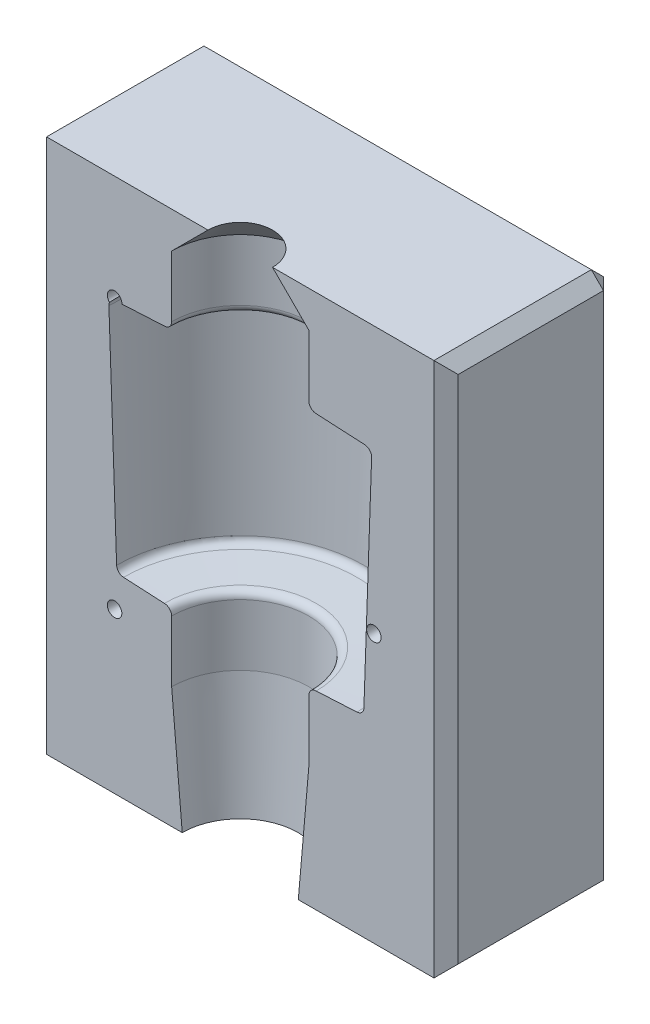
ISO-10303-21;
HEADER;
FILE_DESCRIPTION(('STEP AP214'),'2;1');
FILE_NAME('part.step','',(''),(''),'','','');
FILE_SCHEMA(('AUTOMOTIVE_DESIGN { 1 0 10303 214 1 1 1 1 }'));
ENDSEC;
DATA;
#1=APPLICATION_CONTEXT('core data for automotive mechanical design processes');
#2=APPLICATION_PROTOCOL_DEFINITION('international standard','automotive_design',2000,#1);
#3=PRODUCT_CONTEXT('',#1,'mechanical');
#4=PRODUCT('Part','Part','',(#3));
#5=PRODUCT_RELATED_PRODUCT_CATEGORY('part','',(#4));
#6=PRODUCT_DEFINITION_FORMATION('','',#4);
#7=PRODUCT_DEFINITION_CONTEXT('part definition',#1,'design');
#8=PRODUCT_DEFINITION('design','',#6,#7);
#9=PRODUCT_DEFINITION_SHAPE('','',#8);
#10=(LENGTH_UNIT() NAMED_UNIT(*) SI_UNIT(.MILLI.,.METRE.));
#11=(NAMED_UNIT(*) PLANE_ANGLE_UNIT() SI_UNIT($,.RADIAN.));
#12=(NAMED_UNIT(*) SI_UNIT($,.STERADIAN.) SOLID_ANGLE_UNIT());
#13=UNCERTAINTY_MEASURE_WITH_UNIT(LENGTH_MEASURE(1.E-05),#10,'distance_accuracy_value','');
#14=(GEOMETRIC_REPRESENTATION_CONTEXT(3) GLOBAL_UNCERTAINTY_ASSIGNED_CONTEXT((#13)) GLOBAL_UNIT_ASSIGNED_CONTEXT((#10,
#11,#12)) REPRESENTATION_CONTEXT('',''));
#15=CARTESIAN_POINT('',(0.,0.,0.));
#16=DIRECTION('',(0.,0.,1.));
#17=DIRECTION('',(1.,0.,0.));
#18=AXIS2_PLACEMENT_3D('',#15,#16,#17);
#19=CARTESIAN_POINT('',(-85.,92.9352226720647,-70.));
#20=DIRECTION('',(0.,1.,0.));
#21=DIRECTION('',(-1.,0.,0.));
#22=AXIS2_PLACEMENT_3D('',#19,#20,#21);
#23=PLANE('',#22);
#24=DIRECTION('',(-1.,0.,0.));
#25=VECTOR('',#24,1.);
#26=CARTESIAN_POINT('',(-85.,92.9352226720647,-65.));
#27=LINE('',#26,#25);
#28=CARTESIAN_POINT('',(80.,92.9352226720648,-65.));
#29=VERTEX_POINT('',#28);
#30=CARTESIAN_POINT('',(-80.,92.9352226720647,-65.));
#31=VERTEX_POINT('',#30);
#32=EDGE_CURVE('E50',#29,#31,#27,.T.);
#33=ORIENTED_EDGE('',*,*,#32,.T.);
#34=DIRECTION('',(0.,0.,1.));
#35=VECTOR('',#34,1.);
#36=CARTESIAN_POINT('',(-80.,92.9352226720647,-70.));
#37=LINE('',#36,#35);
#38=CARTESIAN_POINT('',(-80.,92.9352226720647,0.));
#39=VERTEX_POINT('',#38);
#40=EDGE_CURVE('E42',#31,#39,#37,.T.);
#41=ORIENTED_EDGE('',*,*,#40,.T.);
#42=DIRECTION('',(-1.,0.,0.));
#43=VECTOR('',#42,1.);
#44=CARTESIAN_POINT('',(-85.,92.9352226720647,0.));
#45=LINE('',#44,#43);
#46=CARTESIAN_POINT('',(-13.3400809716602,92.9352226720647,0.));
#47=VERTEX_POINT('',#46);
#48=EDGE_CURVE('E318',#47,#39,#45,.T.);
#49=ORIENTED_EDGE('',*,*,#48,.F.);
#50=CARTESIAN_POINT('',(-3.20923843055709E-13,92.9352226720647,0.));
#51=DIRECTION('',(0.,1.,0.));
#52=DIRECTION('',(-0.964273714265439,0.,0.264907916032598));
#53=AXIS2_PLACEMENT_3D('',#50,#51,#52);
#54=CIRCLE('',#53,13.3400809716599);
#55=CARTESIAN_POINT('',(13.3400809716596,92.9352226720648,0.));
#56=VERTEX_POINT('',#55);
#57=EDGE_CURVE('E446',#56,#47,#54,.T.);
#58=ORIENTED_EDGE('',*,*,#57,.F.);
#59=CARTESIAN_POINT('',(80.,92.9352226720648,0.));
#60=VERTEX_POINT('',#59);
#61=EDGE_CURVE('E319',#60,#56,#45,.T.);
#62=ORIENTED_EDGE('',*,*,#61,.F.);
#63=DIRECTION('',(0.,0.,-1.));
#64=VECTOR('',#63,1.);
#65=CARTESIAN_POINT('',(80.,92.9352226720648,-70.));
#66=LINE('',#65,#64);
#67=EDGE_CURVE('E55',#60,#29,#66,.T.);
#68=ORIENTED_EDGE('',*,*,#67,.T.);
#69=EDGE_LOOP('',(#33,#41,#49,#58,#62,#68));
#70=FACE_BOUND('',#69,.T.);
#71=ADVANCED_FACE('F33',(#70),#23,.T.);
#72=CARTESIAN_POINT('',(-85.,-127.935222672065,-70.));
#73=DIRECTION('',(0.,-1.,0.));
#74=DIRECTION('',(0.,0.,-1.));
#75=AXIS2_PLACEMENT_3D('',#72,#73,#74);
#76=PLANE('',#75);
#77=DIRECTION('',(1.,0.,0.));
#78=VECTOR('',#77,1.);
#79=CARTESIAN_POINT('',(-85.,-127.935222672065,0.));
#80=LINE('',#79,#78);
#81=CARTESIAN_POINT('',(-80.,-127.935222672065,0.));
#82=VERTEX_POINT('',#81);
#83=CARTESIAN_POINT('',(-23.9656477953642,-127.935222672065,0.));
#84=VERTEX_POINT('',#83);
#85=EDGE_CURVE('E316',#82,#84,#80,.T.);
#86=ORIENTED_EDGE('',*,*,#85,.F.);
#87=DIRECTION('',(0.,0.,-1.));
#88=VECTOR('',#87,1.);
#89=CARTESIAN_POINT('',(-80.,-127.935222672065,-70.));
#90=LINE('',#89,#88);
#91=CARTESIAN_POINT('',(-80.,-127.935222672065,-65.));
#92=VERTEX_POINT('',#91);
#93=EDGE_CURVE('E326',#82,#92,#90,.T.);
#94=ORIENTED_EDGE('',*,*,#93,.T.);
#95=DIRECTION('',(1.,0.,0.));
#96=VECTOR('',#95,1.);
#97=CARTESIAN_POINT('',(85.,-127.935222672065,-65.));
#98=LINE('',#97,#96);
#99=CARTESIAN_POINT('',(80.,-127.935222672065,-65.));
#100=VERTEX_POINT('',#99);
#101=EDGE_CURVE('E323',#92,#100,#98,.T.);
#102=ORIENTED_EDGE('',*,*,#101,.T.);
#103=DIRECTION('',(0.,0.,1.));
#104=VECTOR('',#103,1.);
#105=CARTESIAN_POINT('',(80.,-127.935222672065,-70.));
#106=LINE('',#105,#104);
#107=CARTESIAN_POINT('',(80.,-127.935222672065,0.));
#108=VERTEX_POINT('',#107);
#109=EDGE_CURVE('E321',#100,#108,#106,.T.);
#110=ORIENTED_EDGE('',*,*,#109,.T.);
#111=CARTESIAN_POINT('',(23.9656477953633,-127.935222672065,0.));
#112=VERTEX_POINT('',#111);
#113=EDGE_CURVE('E315',#112,#108,#80,.T.);
#114=ORIENTED_EDGE('',*,*,#113,.F.);
#115=CARTESIAN_POINT('',(-4.49293380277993E-13,-127.935222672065,0.));
#116=DIRECTION('',(0.,-1.,0.));
#117=DIRECTION('',(0.964273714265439,0.,-0.264907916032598));
#118=AXIS2_PLACEMENT_3D('',#115,#116,#117);
#119=CIRCLE('',#118,23.9656477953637);
#120=EDGE_CURVE('E444',#84,#112,#119,.T.);
#121=ORIENTED_EDGE('',*,*,#120,.F.);
#122=EDGE_LOOP('',(#86,#94,#102,#110,#114,#121));
#123=FACE_BOUND('',#122,.T.);
#124=ADVANCED_FACE('F545',(#123),#76,.T.);
#125=CARTESIAN_POINT('',(-85.,-127.935222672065,0.));
#126=DIRECTION('',(0.,0.,1.));
#127=DIRECTION('',(1.,0.,0.));
#128=AXIS2_PLACEMENT_3D('',#125,#126,#127);
#129=PLANE('',#128);
#130=ORIENTED_EDGE('',*,*,#113,.T.);
#131=DIRECTION('',(0.,1.,0.));
#132=VECTOR('',#131,1.);
#133=CARTESIAN_POINT('',(80.,-127.935222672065,0.));
#134=LINE('',#133,#132);
#135=EDGE_CURVE('E11',#108,#60,#134,.T.);
#136=ORIENTED_EDGE('',*,*,#135,.T.);
#137=ORIENTED_EDGE('',*,*,#61,.T.);
#138=DIRECTION('',(-0.707106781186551,0.707106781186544,0.));
#139=VECTOR('',#138,1.);
#140=CARTESIAN_POINT('',(-3.65965075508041E-13,106.275303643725,0.));
#141=LINE('',#140,#139);
#142=CARTESIAN_POINT('',(28.3400809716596,77.9352226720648,0.));
#143=VERTEX_POINT('',#142);
#144=EDGE_CURVE('E489',#56,#143,#141,.F.);
#145=ORIENTED_EDGE('',*,*,#144,.T.);
#146=DIRECTION('',(0.,1.,0.));
#147=VECTOR('',#146,1.);
#148=CARTESIAN_POINT('',(28.3400809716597,49.5951417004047,0.));
#149=LINE('',#148,#147);
#150=CARTESIAN_POINT('',(28.3400809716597,52.6315789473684,0.));
#151=VERTEX_POINT('',#150);
#152=EDGE_CURVE('E487',#151,#143,#149,.T.);
#153=ORIENTED_EDGE('',*,*,#152,.F.);
#154=CARTESIAN_POINT('',(31.3765182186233,52.6315789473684,0.));
#155=DIRECTION('',(0.,0.,1.));
#156=DIRECTION('',(1.,0.,0.));
#157=AXIS2_PLACEMENT_3D('',#154,#155,#156);
#158=CIRCLE('',#157,3.03643724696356);
#159=CARTESIAN_POINT('',(31.3765182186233,49.5951417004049,0.));
#160=VERTEX_POINT('',#159);
#161=EDGE_CURVE('E222',#151,#160,#158,.T.);
#162=ORIENTED_EDGE('',*,*,#161,.T.);
#163=DIRECTION('',(-0.998629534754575,0.0523359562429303,0.));
#164=VECTOR('',#163,1.);
#165=CARTESIAN_POINT('',(-1.86929983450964E-13,51.2395153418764,0.));
#166=LINE('',#165,#164);
#167=CARTESIAN_POINT('',(51.4134087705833,48.5450527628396,0.));
#168=VERTEX_POINT('',#167);
#169=EDGE_CURVE('E210',#168,#160,#166,.T.);
#170=ORIENTED_EDGE('',*,*,#169,.F.);
#171=CARTESIAN_POINT('',(51.2564009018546,45.5491641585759,0.));
#172=DIRECTION('',(0.,0.,1.));
#173=DIRECTION('',(1.,0.,0.));
#174=AXIS2_PLACEMENT_3D('',#171,#172,#173);
#175=CIRCLE('',#174,3.);
#176=CARTESIAN_POINT('',(54.2545733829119,45.4444656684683,0.));
#177=VERTEX_POINT('',#176);
#178=EDGE_CURVE('E195',#177,#168,#175,.T.);
#179=ORIENTED_EDGE('',*,*,#178,.F.);
#180=DIRECTION('',(0.0348994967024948,0.999390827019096,0.));
#181=VECTOR('',#180,1.);
#182=CARTESIAN_POINT('',(5.60880223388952E-12,-1508.20323948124,0.));
#183=LINE('',#182,#181);
#184=CARTESIAN_POINT('',(51.0675169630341,-45.8208891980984,0.));
#185=VERTEX_POINT('',#184);
#186=EDGE_CURVE('E301',#185,#177,#183,.T.);
#187=ORIENTED_EDGE('',*,*,#186,.F.);
#188=CARTESIAN_POINT('',(48.0693444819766,-45.7161907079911,0.));
#189=DIRECTION('',(0.,0.,1.));
#190=DIRECTION('',(1.,0.,0.));
#191=AXIS2_PLACEMENT_3D('',#188,#189,#190);
#192=CIRCLE('',#191,3.);
#193=CARTESIAN_POINT('',(48.2263523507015,-48.7120793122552,0.));
#194=VERTEX_POINT('',#193);
#195=EDGE_CURVE('E470',#194,#185,#192,.T.);
#196=ORIENTED_EDGE('',*,*,#195,.F.);
#197=DIRECTION('',(0.998629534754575,0.0523359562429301,0.));
#198=VECTOR('',#197,1.);
#199=CARTESIAN_POINT('',(-1.79221398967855E-13,-51.2395153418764,0.));
#200=LINE('',#199,#198);
#201=CARTESIAN_POINT('',(31.3765182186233,-49.5951417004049,0.));
#202=VERTEX_POINT('',#201);
#203=EDGE_CURVE('E476',#194,#202,#200,.F.);
#204=ORIENTED_EDGE('',*,*,#203,.T.);
#205=CARTESIAN_POINT('',(31.3765182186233,-52.6315789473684,0.));
#206=DIRECTION('',(0.,0.,1.));
#207=DIRECTION('',(1.,0.,0.));
#208=AXIS2_PLACEMENT_3D('',#205,#206,#207);
#209=CIRCLE('',#208,3.03643724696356);
#210=CARTESIAN_POINT('',(28.3400809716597,-52.6315789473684,0.));
#211=VERTEX_POINT('',#210);
#212=EDGE_CURVE('E480',#202,#211,#209,.T.);
#213=ORIENTED_EDGE('',*,*,#212,.T.);
#214=DIRECTION('',(0.,-1.,0.));
#215=VECTOR('',#214,1.);
#216=CARTESIAN_POINT('',(28.3400809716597,-49.5951417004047,0.));
#217=LINE('',#216,#215);
#218=CARTESIAN_POINT('',(28.3400809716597,-77.9352226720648,0.));
#219=VERTEX_POINT('',#218);
#220=EDGE_CURVE('E460',#219,#211,#217,.F.);
#221=ORIENTED_EDGE('',*,*,#220,.F.);
#222=DIRECTION('',(0.0871557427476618,0.996194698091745,0.));
#223=VECTOR('',#222,1.);
#224=CARTESIAN_POINT('',(-1.40334292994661E-12,-401.863830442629,0.));
#225=LINE('',#224,#223);
#226=EDGE_CURVE('E483',#219,#112,#225,.F.);
#227=ORIENTED_EDGE('',*,*,#226,.T.);
#228=EDGE_LOOP('',(#130,#136,#137,#145,#153,#162,#170,#179,#187,#196,#204,#213,#221,#227));
#229=FACE_BOUND('',#228,.T.);
#230=CARTESIAN_POINT('',(55.1779259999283,-17.1461572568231,0.));
#231=DIRECTION('',(0.,0.,1.));
#232=DIRECTION('',(1.,0.,0.));
#233=AXIS2_PLACEMENT_3D('',#230,#231,#232);
#234=CIRCLE('',#233,3.);
#235=CARTESIAN_POINT('',(58.1779259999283,-17.1461572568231,0.));
#236=VERTEX_POINT('',#235);
#237=EDGE_CURVE('E223',#236,#236,#234,.T.);
#238=ORIENTED_EDGE('',*,*,#237,.F.);
#239=EDGE_LOOP('',(#238));
#240=FACE_BOUND('',#239,.T.);
#241=ADVANCED_FACE('F219',(#229,#240),#129,.T.);
#242=ORIENTED_EDGE('',*,*,#48,.T.);
#243=DIRECTION('',(0.,-1.,0.));
#244=VECTOR('',#243,1.);
#245=CARTESIAN_POINT('',(-80.,-127.935222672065,0.));
#246=LINE('',#245,#244);
#247=EDGE_CURVE('E355',#39,#82,#246,.T.);
#248=ORIENTED_EDGE('',*,*,#247,.T.);
#249=ORIENTED_EDGE('',*,*,#85,.T.);
#250=DIRECTION('',(0.0871557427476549,-0.996194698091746,0.));
#251=VECTOR('',#250,1.);
#252=CARTESIAN_POINT('',(-1.40334292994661E-12,-401.863830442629,0.));
#253=LINE('',#252,#251);
#254=CARTESIAN_POINT('',(-28.3400809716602,-77.9352226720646,0.));
#255=VERTEX_POINT('',#254);
#256=EDGE_CURVE('E468',#84,#255,#253,.F.);
#257=ORIENTED_EDGE('',*,*,#256,.T.);
#258=DIRECTION('',(0.,-1.,0.));
#259=VECTOR('',#258,1.);
#260=CARTESIAN_POINT('',(-28.3400809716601,-49.5951417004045,0.));
#261=LINE('',#260,#259);
#262=CARTESIAN_POINT('',(-28.3400809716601,-52.6315789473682,0.));
#263=VERTEX_POINT('',#262);
#264=EDGE_CURVE('E457',#263,#255,#261,.T.);
#265=ORIENTED_EDGE('',*,*,#264,.F.);
#266=CARTESIAN_POINT('',(-31.3765182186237,-52.6315789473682,0.));
#267=DIRECTION('',(0.,0.,1.));
#268=DIRECTION('',(1.,0.,0.));
#269=AXIS2_PLACEMENT_3D('',#266,#267,#268);
#270=CIRCLE('',#269,3.03643724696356);
#271=CARTESIAN_POINT('',(-31.3765182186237,-49.5951417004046,0.));
#272=VERTEX_POINT('',#271);
#273=EDGE_CURVE('E466',#263,#272,#270,.T.);
#274=ORIENTED_EDGE('',*,*,#273,.T.);
#275=DIRECTION('',(0.998629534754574,-0.052335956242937,0.));
#276=VECTOR('',#275,1.);
#277=CARTESIAN_POINT('',(-1.79221398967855E-13,-51.2395153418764,0.));
#278=LINE('',#277,#276);
#279=CARTESIAN_POINT('',(-48.2263523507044,-48.7120793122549,0.));
#280=VERTEX_POINT('',#279);
#281=EDGE_CURVE('E857',#272,#280,#278,.F.);
#282=ORIENTED_EDGE('',*,*,#281,.T.);
#283=CARTESIAN_POINT('',(-48.0693444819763,-45.7161907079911,0.));
#284=DIRECTION('',(0.,0.,1.));
#285=DIRECTION('',(1.,0.,0.));
#286=AXIS2_PLACEMENT_3D('',#283,#284,#285);
#287=CIRCLE('',#286,3.);
#288=CARTESIAN_POINT('',(-51.0675169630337,-45.8208891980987,0.));
#289=VERTEX_POINT('',#288);
#290=EDGE_CURVE('E856',#289,#280,#287,.T.);
#291=ORIENTED_EDGE('',*,*,#290,.F.);
#292=DIRECTION('',(0.0348994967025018,-0.999390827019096,0.));
#293=VECTOR('',#292,1.);
#294=CARTESIAN_POINT('',(5.60880223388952E-12,-1508.20323948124,0.));
#295=LINE('',#294,#293);
#296=CARTESIAN_POINT('',(-54.2545733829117,45.4444656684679,0.));
#297=VERTEX_POINT('',#296);
#298=EDGE_CURVE('E298',#297,#289,#295,.T.);
#299=ORIENTED_EDGE('',*,*,#298,.F.);
#300=CARTESIAN_POINT('',(-51.2564009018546,45.5491641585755,0.));
#301=DIRECTION('',(0.,0.,1.));
#302=DIRECTION('',(1.,0.,0.));
#303=AXIS2_PLACEMENT_3D('',#300,#301,#302);
#304=CIRCLE('',#303,3.);
#305=CARTESIAN_POINT('',(-54.0021832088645,46.7577499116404,0.));
#306=VERTEX_POINT('',#305);
#307=EDGE_CURVE('E205',#306,#297,#304,.T.);
#308=ORIENTED_EDGE('',*,*,#307,.F.);
#309=CARTESIAN_POINT('',(-51.9184688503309,48.9160210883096,0.));
#310=DIRECTION('',(0.,0.,1.));
#311=DIRECTION('',(1.,0.,0.));
#312=AXIS2_PLACEMENT_3D('',#309,#310,#311);
#313=CIRCLE('',#312,3.);
#314=CARTESIAN_POINT('',(-48.9281422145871,48.6753000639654,0.));
#315=VERTEX_POINT('',#314);
#316=EDGE_CURVE('E234',#315,#306,#313,.T.);
#317=ORIENTED_EDGE('',*,*,#316,.F.);
#318=DIRECTION('',(-0.998629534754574,-0.0523359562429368,0.));
#319=VECTOR('',#318,1.);
#320=CARTESIAN_POINT('',(-1.86929983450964E-13,51.2395153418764,0.));
#321=LINE('',#320,#319);
#322=CARTESIAN_POINT('',(-31.3765182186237,49.5951417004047,0.));
#323=VERTEX_POINT('',#322);
#324=EDGE_CURVE('E224',#323,#315,#321,.T.);
#325=ORIENTED_EDGE('',*,*,#324,.F.);
#326=CARTESIAN_POINT('',(-31.3765182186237,52.6315789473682,0.));
#327=DIRECTION('',(0.,0.,1.));
#328=DIRECTION('',(1.,0.,0.));
#329=AXIS2_PLACEMENT_3D('',#326,#327,#328);
#330=CIRCLE('',#329,3.03643724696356);
#331=CARTESIAN_POINT('',(-28.3400809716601,52.6315789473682,0.));
#332=VERTEX_POINT('',#331);
#333=EDGE_CURVE('E435',#323,#332,#330,.T.);
#334=ORIENTED_EDGE('',*,*,#333,.T.);
#335=DIRECTION('',(0.,1.,0.));
#336=VECTOR('',#335,1.);
#337=CARTESIAN_POINT('',(-28.3400809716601,49.5951417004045,0.));
#338=LINE('',#337,#336);
#339=CARTESIAN_POINT('',(-28.3400809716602,77.9352226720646,0.));
#340=VERTEX_POINT('',#339);
#341=EDGE_CURVE('E426',#340,#332,#338,.F.);
#342=ORIENTED_EDGE('',*,*,#341,.F.);
#343=DIRECTION('',(-0.707106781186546,-0.707106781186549,0.));
#344=VECTOR('',#343,1.);
#345=CARTESIAN_POINT('',(-3.65965075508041E-13,106.275303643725,0.));
#346=LINE('',#345,#344);
#347=EDGE_CURVE('E425',#340,#47,#346,.F.);
#348=ORIENTED_EDGE('',*,*,#347,.T.);
#349=EDGE_LOOP('',(#242,#248,#249,#257,#265,#274,#282,#291,#299,#308,#317,#325,#334,#342,#348));
#350=FACE_BOUND('',#349,.T.);
#351=CARTESIAN_POINT('',(-51.9184688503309,-61.9636703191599,0.));
#352=DIRECTION('',(0.,0.,1.));
#353=DIRECTION('',(1.,0.,0.));
#354=AXIS2_PLACEMENT_3D('',#351,#352,#353);
#355=CIRCLE('',#354,3.);
#356=CARTESIAN_POINT('',(-48.9184688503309,-61.9636703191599,0.));
#357=VERTEX_POINT('',#356);
#358=EDGE_CURVE('E240',#357,#357,#355,.T.);
#359=ORIENTED_EDGE('',*,*,#358,.F.);
#360=EDGE_LOOP('',(#359));
#361=FACE_BOUND('',#360,.T.);
#362=ADVANCED_FACE('F292',(#350,#361),#129,.T.);
#363=CARTESIAN_POINT('',(-85.,92.9352226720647,-70.));
#364=DIRECTION('',(-1.,0.,0.));
#365=DIRECTION('',(0.,-1.,0.));
#366=AXIS2_PLACEMENT_3D('',#363,#364,#365);
#367=PLANE('',#366);
#368=DIRECTION('',(0.,0.,-1.));
#369=VECTOR('',#368,1.);
#370=CARTESIAN_POINT('',(-85.,87.9352226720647,-70.));
#371=LINE('',#370,#369);
#372=CARTESIAN_POINT('',(-85.,87.9352226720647,-5.00000000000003));
#373=VERTEX_POINT('',#372);
#374=CARTESIAN_POINT('',(-85.,87.9352226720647,-65.));
#375=VERTEX_POINT('',#374);
#376=EDGE_CURVE('E346',#373,#375,#371,.T.);
#377=ORIENTED_EDGE('',*,*,#376,.T.);
#378=DIRECTION('',(0.,-1.,0.));
#379=VECTOR('',#378,1.);
#380=CARTESIAN_POINT('',(-85.,-127.935222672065,-65.));
#381=LINE('',#380,#379);
#382=CARTESIAN_POINT('',(-85.,-122.935222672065,-65.));
#383=VERTEX_POINT('',#382);
#384=EDGE_CURVE('E352',#375,#383,#381,.T.);
#385=ORIENTED_EDGE('',*,*,#384,.T.);
#386=DIRECTION('',(0.,0.,1.));
#387=VECTOR('',#386,1.);
#388=CARTESIAN_POINT('',(-85.,-122.935222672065,-70.));
#389=LINE('',#388,#387);
#390=CARTESIAN_POINT('',(-85.,-122.935222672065,-5.00000000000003));
#391=VERTEX_POINT('',#390);
#392=EDGE_CURVE('E350',#383,#391,#389,.T.);
#393=ORIENTED_EDGE('',*,*,#392,.T.);
#394=DIRECTION('',(0.,1.,0.));
#395=VECTOR('',#394,1.);
#396=CARTESIAN_POINT('',(-85.,92.9352226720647,-5.00000000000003));
#397=LINE('',#396,#395);
#398=EDGE_CURVE('E348',#391,#373,#397,.T.);
#399=ORIENTED_EDGE('',*,*,#398,.T.);
#400=EDGE_LOOP('',(#377,#385,#393,#399));
#401=FACE_BOUND('',#400,.T.);
#402=ADVANCED_FACE('F414',(#401),#367,.T.);
#403=CARTESIAN_POINT('',(85.,92.9352226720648,-70.));
#404=DIRECTION('',(1.,0.,0.));
#405=DIRECTION('',(0.,1.,0.));
#406=AXIS2_PLACEMENT_3D('',#403,#404,#405);
#407=PLANE('',#406);
#408=DIRECTION('',(0.,0.,-1.));
#409=VECTOR('',#408,1.);
#410=CARTESIAN_POINT('',(85.,-122.935222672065,-70.));
#411=LINE('',#410,#409);
#412=CARTESIAN_POINT('',(85.,-122.935222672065,-5.));
#413=VERTEX_POINT('',#412);
#414=CARTESIAN_POINT('',(85.,-122.935222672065,-65.));
#415=VERTEX_POINT('',#414);
#416=EDGE_CURVE('E341',#413,#415,#411,.T.);
#417=ORIENTED_EDGE('',*,*,#416,.T.);
#418=DIRECTION('',(0.,1.,0.));
#419=VECTOR('',#418,1.);
#420=CARTESIAN_POINT('',(85.,92.9352226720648,-65.));
#421=LINE('',#420,#419);
#422=CARTESIAN_POINT('',(85.,87.9352226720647,-65.));
#423=VERTEX_POINT('',#422);
#424=EDGE_CURVE('E343',#415,#423,#421,.T.);
#425=ORIENTED_EDGE('',*,*,#424,.T.);
#426=DIRECTION('',(0.,0.,1.));
#427=VECTOR('',#426,1.);
#428=CARTESIAN_POINT('',(85.,87.9352226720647,-70.));
#429=LINE('',#428,#427);
#430=CARTESIAN_POINT('',(85.,87.9352226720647,-5.));
#431=VERTEX_POINT('',#430);
#432=EDGE_CURVE('E337',#423,#431,#429,.T.);
#433=ORIENTED_EDGE('',*,*,#432,.T.);
#434=DIRECTION('',(0.,-1.,0.));
#435=VECTOR('',#434,1.);
#436=CARTESIAN_POINT('',(85.,92.9352226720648,-5.));
#437=LINE('',#436,#435);
#438=EDGE_CURVE('E339',#431,#413,#437,.T.);
#439=ORIENTED_EDGE('',*,*,#438,.T.);
#440=EDGE_LOOP('',(#417,#425,#433,#439));
#441=FACE_BOUND('',#440,.T.);
#442=ADVANCED_FACE('F509',(#441),#407,.T.);
#443=CARTESIAN_POINT('',(-85.,-127.935222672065,-70.));
#444=DIRECTION('',(0.,0.,1.));
#445=DIRECTION('',(1.,0.,0.));
#446=AXIS2_PLACEMENT_3D('',#443,#444,#445);
#447=PLANE('',#446);
#448=DIRECTION('',(0.,-1.,0.));
#449=VECTOR('',#448,1.);
#450=CARTESIAN_POINT('',(80.,-127.935222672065,-70.));
#451=LINE('',#450,#449);
#452=CARTESIAN_POINT('',(80.,87.9352226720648,-70.));
#453=VERTEX_POINT('',#452);
#454=CARTESIAN_POINT('',(80.,-122.935222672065,-70.));
#455=VERTEX_POINT('',#454);
#456=EDGE_CURVE('E332',#453,#455,#451,.T.);
#457=ORIENTED_EDGE('',*,*,#456,.T.);
#458=DIRECTION('',(-1.,0.,0.));
#459=VECTOR('',#458,1.);
#460=CARTESIAN_POINT('',(-85.,-122.935222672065,-70.));
#461=LINE('',#460,#459);
#462=CARTESIAN_POINT('',(-80.,-122.935222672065,-70.));
#463=VERTEX_POINT('',#462);
#464=EDGE_CURVE('E334',#455,#463,#461,.T.);
#465=ORIENTED_EDGE('',*,*,#464,.T.);
#466=DIRECTION('',(0.,1.,0.));
#467=VECTOR('',#466,1.);
#468=CARTESIAN_POINT('',(-80.,92.9352226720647,-70.));
#469=LINE('',#468,#467);
#470=CARTESIAN_POINT('',(-80.,87.9352226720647,-70.));
#471=VERTEX_POINT('',#470);
#472=EDGE_CURVE('E330',#463,#471,#469,.T.);
#473=ORIENTED_EDGE('',*,*,#472,.T.);
#474=DIRECTION('',(1.,0.,0.));
#475=VECTOR('',#474,1.);
#476=CARTESIAN_POINT('',(85.,87.9352226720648,-70.));
#477=LINE('',#476,#475);
#478=EDGE_CURVE('E328',#471,#453,#477,.T.);
#479=ORIENTED_EDGE('',*,*,#478,.T.);
#480=EDGE_LOOP('',(#457,#465,#473,#479));
#481=FACE_BOUND('',#480,.T.);
#482=ADVANCED_FACE('F529',(#481),#447,.F.);
#483=CARTESIAN_POINT('',(-51.9184688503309,48.9160210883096,-5.));
#484=DIRECTION('',(0.,0.,1.));
#485=DIRECTION('',(1.,0.,0.));
#486=AXIS2_PLACEMENT_3D('',#483,#484,#485);
#487=PLANE('',#486);
#488=CARTESIAN_POINT('',(-51.9184688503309,48.9160210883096,-5.));
#489=DIRECTION('',(0.,0.,1.));
#490=DIRECTION('',(1.,0.,0.));
#491=AXIS2_PLACEMENT_3D('',#488,#489,#490);
#492=CIRCLE('',#491,2.11836509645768);
#493=CARTESIAN_POINT('',(-49.8215484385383,48.6153626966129,-5.));
#494=VERTEX_POINT('',#493);
#495=CARTESIAN_POINT('',(-53.3899467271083,47.3921367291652,-5.));
#496=VERTEX_POINT('',#495);
#497=EDGE_CURVE('E237',#494,#496,#492,.T.);
#498=ORIENTED_EDGE('',*,*,#497,.T.);
#499=CARTESIAN_POINT('',(-53.5058108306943,47.2335294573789,-5.));
#500=CARTESIAN_POINT('',(-53.6004437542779,47.0946455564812,-5.));
#501=CARTESIAN_POINT('',(-53.6834425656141,46.9476897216,-5.));
#502=CARTESIAN_POINT('',(-53.8236679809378,46.6418131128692,-5.));
#503=CARTESIAN_POINT('',(-53.8808646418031,46.482878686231,-5.));
#504=CARTESIAN_POINT('',(-53.9677179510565,46.1577011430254,-5.));
#505=CARTESIAN_POINT('',(-53.9973848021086,45.9914607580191,-5.));
#506=CARTESIAN_POINT('',(-54.0283329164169,45.6564022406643,-5.));
#507=CARTESIAN_POINT('',(-54.0296210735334,45.4875847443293,-5.));
#508=CARTESIAN_POINT('',(-54.0038128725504,45.1523590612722,-5.));
#509=CARTESIAN_POINT('',(-53.9767541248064,44.9859479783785,-5.));
#510=CARTESIAN_POINT('',(-53.8950943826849,44.6600219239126,-5.));
#511=CARTESIAN_POINT('',(-53.8404924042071,44.5005071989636,-5.));
#512=CARTESIAN_POINT('',(-53.705293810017,44.1928122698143,-5.));
#513=CARTESIAN_POINT('',(-53.6246845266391,44.0446376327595,-5.));
#514=CARTESIAN_POINT('',(-53.439802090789,43.7638733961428,-5.));
#515=CARTESIAN_POINT('',(-53.3355286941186,43.6312839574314,-5.));
#516=CARTESIAN_POINT('',(-53.1059673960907,43.3850302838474,-5.));
#517=CARTESIAN_POINT('',(-52.9806194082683,43.2714220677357,-5.));
#518=CARTESIAN_POINT('',(-52.7126989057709,43.066756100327,-5.));
#519=CARTESIAN_POINT('',(-52.5701260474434,42.9756987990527,-5.));
#520=CARTESIAN_POINT('',(-52.2711578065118,42.8183081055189,-5.));
#521=CARTESIAN_POINT('',(-52.114706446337,42.752081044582,-5.));
#522=CARTESIAN_POINT('',(-51.792933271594,42.6467161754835,-5.));
#523=CARTESIAN_POINT('',(-51.6276112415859,42.6075790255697,-5.));
#524=CARTESIAN_POINT('',(-51.2920936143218,42.5573615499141,-5.));
#525=CARTESIAN_POINT('',(-51.1218814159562,42.5463921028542,-5.));
#526=CARTESIAN_POINT('',(-50.7820238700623,42.5531246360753,-5.));
#527=CARTESIAN_POINT('',(-50.6123785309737,42.5708270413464,-5.));
#528=CARTESIAN_POINT('',(-50.2781290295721,42.6344715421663,-5.));
#529=CARTESIAN_POINT('',(-50.1135352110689,42.6804679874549,-5.));
#530=CARTESIAN_POINT('',(-49.7944177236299,42.7994709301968,-5.));
#531=CARTESIAN_POINT('',(-49.6398940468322,42.8724774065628,-5.));
#532=CARTESIAN_POINT('',(-49.3455103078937,43.0433692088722,-5.));
#533=CARTESIAN_POINT('',(-49.205633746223,43.1412261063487,-5.));
#534=CARTESIAN_POINT('',(-48.9443776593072,43.3591209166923,-5.));
#535=CARTESIAN_POINT('',(-48.8229977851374,43.4791584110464,-5.));
#536=CARTESIAN_POINT('',(-48.6027096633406,43.7375086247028,-5.));
#537=CARTESIAN_POINT('',(-48.5037141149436,43.8757468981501,-5.));
#538=CARTESIAN_POINT('',(-48.3304763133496,44.1669502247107,-5.));
#539=CARTESIAN_POINT('',(-48.2562333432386,44.3199148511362,-5.));
#540=CARTESIAN_POINT('',(-48.1350016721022,44.6353914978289,-5.));
#541=CARTESIAN_POINT('',(-48.0878759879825,44.7978508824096,-5.));
#542=CARTESIAN_POINT('',(-48.0216830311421,45.1283878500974,-5.));
#543=CARTESIAN_POINT('',(-48.0026150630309,45.2964652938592,-5.));
#544=CARTESIAN_POINT('',(-47.9931180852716,45.6327962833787,-5.));
#545=CARTESIAN_POINT('',(-48.00258234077,45.8010468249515,-5.));
#546=CARTESIAN_POINT('',(-48.0496390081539,46.1335655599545,-5.));
#547=CARTESIAN_POINT('',(-48.0872312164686,46.2978337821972,-5.));
#548=CARTESIAN_POINT('',(-48.1894184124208,46.6176598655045,-5.));
#549=CARTESIAN_POINT('',(-48.2540012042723,46.7732216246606,-5.));
#550=CARTESIAN_POINT('',(-48.4082897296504,47.0713405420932,-5.));
#551=CARTESIAN_POINT('',(-48.4979957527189,47.2138975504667,-5.));
#552=CARTESIAN_POINT('',(-48.7002564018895,47.4824416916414,-5.));
#553=CARTESIAN_POINT('',(-48.8128799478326,47.6083769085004,-5.));
#554=CARTESIAN_POINT('',(-49.0575774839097,47.8396680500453,-5.));
#555=CARTESIAN_POINT('',(-49.1896520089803,47.9450234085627,-5.));
#556=CARTESIAN_POINT('',(-49.4702044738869,48.132721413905,-5.));
#557=CARTESIAN_POINT('',(-49.6187607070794,48.2149470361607,-5.));
#558=CARTESIAN_POINT('',(-49.9275243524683,48.3534193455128,-5.));
#559=CARTESIAN_POINT('',(-50.087732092,48.4096653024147,-5.));
#560=CARTESIAN_POINT('',(-50.4160229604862,48.4948237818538,-5.));
#561=CARTESIAN_POINT('',(-50.5841381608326,48.523612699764,-5.));
#562=CARTESIAN_POINT('',(-50.9228103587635,48.5526186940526,-5.));
#563=CARTESIAN_POINT('',(-51.0933672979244,48.5528364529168,-5.));
#564=CARTESIAN_POINT('',(-51.432424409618,48.5246625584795,-5.));
#565=CARTESIAN_POINT('',(-51.6009201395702,48.4962174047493,-5.));
#566=CARTESIAN_POINT('',(-51.9307801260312,48.4113996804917,-5.));
#567=CARTESIAN_POINT('',(-52.092142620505,48.3550202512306,-5.));
#568=CARTESIAN_POINT('',(-52.4029547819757,48.2159576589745,-5.));
#569=CARTESIAN_POINT('',(-52.5524126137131,48.1332927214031,-5.));
#570=CARTESIAN_POINT('',(-52.8351220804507,47.9440079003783,-5.));
#571=CARTESIAN_POINT('',(-52.9683932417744,47.8374173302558,-5.));
#572=CARTESIAN_POINT('',(-53.1690811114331,47.6469357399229,-5.));
#573=CARTESIAN_POINT('',(-53.2425656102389,47.5693295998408,-5.));
#574=CARTESIAN_POINT('',(-53.3808690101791,47.4067448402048,-5.));
#575=CARTESIAN_POINT('',(-53.4456879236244,47.321766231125,-5.));
#576=CARTESIAN_POINT('',(-53.5058108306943,47.2335294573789,-5.));
#577=B_SPLINE_CURVE_WITH_KNOTS('',3,(#499,#500,#501,#502,#503,#504,#505,#506,#507,#508,#509,
#510,#511,#512,#513,#514,#515,#516,#517,#518,#519,#520,#521,#522,#523,#524,#525,#526,#527,#528,
#529,#530,#531,#532,#533,#534,#535,#536,#537,#538,#539,#540,#541,#542,#543,#544,#545,#546,#547,
#548,#549,#550,#551,#552,#553,#554,#555,#556,#557,#558,#559,#560,#561,#562,#563,#564,#565,#566,
#567,#568,#569,#570,#571,#572,#573,#574,#575,#576),.UNSPECIFIED.,.T.,.F.,(4,2,2,2,2,2,2,2,2,2,2,
2,2,2,2,2,2,2,2,2,2,2,2,2,2,2,2,2,2,2,2,2,2,2,2,2,2,2,4),(0.,0.503791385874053,1.00816592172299,
1.51235345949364,2.01641851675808,2.5198156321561,3.02323073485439,3.5268914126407,
4.03055728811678,4.53568432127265,5.04082143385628,5.54809765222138,6.05538619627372,
6.56466857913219,7.0739585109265,7.58422980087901,8.09450069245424,8.60419045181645,
9.11387059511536,9.62152727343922,10.1291692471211,10.634223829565,11.1392658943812,
11.6424210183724,12.1455725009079,12.64849687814,13.1514270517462,13.6558926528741,
14.1603721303,14.6673598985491,15.1743619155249,15.6836357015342,16.1928973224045,
16.7031112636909,17.2134505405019,17.7234367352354,18.2328014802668,18.5528745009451,
18.8729470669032),.UNSPECIFIED.);
#578=CARTESIAN_POINT('',(-51.169703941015,48.5450527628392,-5.));
#579=VERTEX_POINT('',#578);
#580=EDGE_CURVE('E246',#579,#496,#577,.T.);
#581=ORIENTED_EDGE('',*,*,#580,.F.);
#582=CARTESIAN_POINT('',(-47.4731345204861,48.7377925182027,-5.));
#583=CARTESIAN_POINT('',(-48.7147493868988,48.6730766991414,-5.));
#584=CARTESIAN_POINT('',(-49.9563630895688,48.6083385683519,-5.));
#585=CARTESIAN_POINT('',(-52.439588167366,48.4788176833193,-5.));
#586=CARTESIAN_POINT('',(-53.6811995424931,48.4140349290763,-5.));
#587=CARTESIAN_POINT('',(-54.9228097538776,48.3492298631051,-5.));
#588=B_SPLINE_CURVE_WITH_KNOTS('',3,(#582,#583,#584,#585,#586,#587),.UNSPECIFIED.,.F.,.F.,(4,2,
4),(0.,3.72990087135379,7.45980174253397),.UNSPECIFIED.);
#589=EDGE_CURVE('E213',#494,#579,#588,.T.);
#590=ORIENTED_EDGE('',*,*,#589,.F.);
#591=EDGE_LOOP('',(#498,#581,#590));
#592=FACE_BOUND('',#591,.T.);
#593=ADVANCED_FACE('F257',(#592),#487,.T.);
#594=CARTESIAN_POINT('',(1.83880688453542E-13,-45.7161907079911,0.));
#595=DIRECTION('',(0.,1.,0.));
#596=DIRECTION('',(0.264907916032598,0.,0.964273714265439));
#597=AXIS2_PLACEMENT_3D('',#594,#595,#596);
#598=TOROIDAL_SURFACE('',#597,48.0693444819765,3.);
#599=CARTESIAN_POINT('',(1.83880688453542E-13,-45.8208891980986,0.));
#600=DIRECTION('',(0.,1.,0.));
#601=DIRECTION('',(-0.964273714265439,0.,0.264907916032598));
#602=AXIS2_PLACEMENT_3D('',#599,#600,#601);
#603=CIRCLE('',#602,51.067516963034);
#604=EDGE_CURVE('E313',#185,#289,#603,.T.);
#605=ORIENTED_EDGE('',*,*,#604,.T.);
#606=ORIENTED_EDGE('',*,*,#290,.T.);
#607=CARTESIAN_POINT('',(1.85615411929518E-13,-48.712079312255,0.));
#608=DIRECTION('',(0.,1.,0.));
#609=DIRECTION('',(-0.964273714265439,0.,0.264907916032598));
#610=AXIS2_PLACEMENT_3D('',#607,#608,#609);
#611=CIRCLE('',#610,48.2263523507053);
#612=EDGE_CURVE('E215',#280,#194,#611,.F.);
#613=ORIENTED_EDGE('',*,*,#612,.T.);
#614=ORIENTED_EDGE('',*,*,#195,.T.);
#615=EDGE_LOOP('',(#605,#606,#613,#614));
#616=FACE_BOUND('',#615,.T.);
#617=ADVANCED_FACE('F738',(#616),#598,.F.);
#618=CARTESIAN_POINT('',(-1.83880688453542E-13,-52.6315789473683,0.));
#619=DIRECTION('',(0.,-1.,0.));
#620=DIRECTION('',(1.,0.,0.));
#621=AXIS2_PLACEMENT_3D('',#618,#619,#620);
#622=TOROIDAL_SURFACE('',#621,31.3765182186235,3.03643724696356);
#623=ORIENTED_EDGE('',*,*,#212,.F.);
#624=CARTESIAN_POINT('',(-1.73472347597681E-13,-49.5951417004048,0.));
#625=DIRECTION('',(0.,1.,0.));
#626=DIRECTION('',(-0.964273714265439,0.,0.264907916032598));
#627=AXIS2_PLACEMENT_3D('',#624,#625,#626);
#628=CIRCLE('',#627,31.3765182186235);
#629=EDGE_CURVE('E430',#202,#272,#628,.T.);
#630=ORIENTED_EDGE('',*,*,#629,.T.);
#631=ORIENTED_EDGE('',*,*,#273,.F.);
#632=CARTESIAN_POINT('',(-1.83880688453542E-13,-52.6315789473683,0.));
#633=DIRECTION('',(0.,-1.,0.));
#634=DIRECTION('',(1.,0.,0.));
#635=AXIS2_PLACEMENT_3D('',#632,#633,#634);
#636=CIRCLE('',#635,28.3400809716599);
#637=EDGE_CURVE('E308',#211,#263,#636,.F.);
#638=ORIENTED_EDGE('',*,*,#637,.F.);
#639=EDGE_LOOP('',(#623,#630,#631,#638));
#640=FACE_BOUND('',#639,.T.);
#641=ADVANCED_FACE('F729',(#640),#622,.T.);
#642=CARTESIAN_POINT('',(-1.73472347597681E-13,-49.5951417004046,0.));
#643=DIRECTION('',(0.,-1.,0.));
#644=DIRECTION('',(-1.,0.,0.));
#645=AXIS2_PLACEMENT_3D('',#642,#643,#644);
#646=CYLINDRICAL_SURFACE('',#645,28.3400809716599);
#647=ORIENTED_EDGE('',*,*,#637,.T.);
#648=ORIENTED_EDGE('',*,*,#264,.T.);
#649=CARTESIAN_POINT('',(-2.72351585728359E-13,-77.9352226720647,0.));
#650=DIRECTION('',(0.,-1.,0.));
#651=DIRECTION('',(0.964273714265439,0.,-0.264907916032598));
#652=AXIS2_PLACEMENT_3D('',#649,#650,#651);
#653=CIRCLE('',#652,28.3400809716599);
#654=EDGE_CURVE('E440',#255,#219,#653,.T.);
#655=ORIENTED_EDGE('',*,*,#654,.T.);
#656=ORIENTED_EDGE('',*,*,#220,.T.);
#657=EDGE_LOOP('',(#647,#648,#655,#656));
#658=FACE_BOUND('',#657,.T.);
#659=ADVANCED_FACE('F456',(#658),#646,.F.);
#660=CARTESIAN_POINT('',(-2.72351585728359E-13,-77.9352226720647,0.));
#661=DIRECTION('',(0.,1.,0.));
#662=DIRECTION('',(0.964273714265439,0.,-0.264907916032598));
#663=AXIS2_PLACEMENT_3D('',#660,#661,#662);
#664=CONICAL_SURFACE('',#663,28.3400809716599,0.0872664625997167);
#665=ORIENTED_EDGE('',*,*,#226,.F.);
#666=ORIENTED_EDGE('',*,*,#654,.F.);
#667=ORIENTED_EDGE('',*,*,#256,.F.);
#668=ORIENTED_EDGE('',*,*,#120,.T.);
#669=EDGE_LOOP('',(#665,#666,#667,#668));
#670=FACE_BOUND('',#669,.T.);
#671=ADVANCED_FACE('F710',(#670),#664,.F.);
#672=CARTESIAN_POINT('',(-1.73472347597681E-13,-49.5951417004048,0.));
#673=DIRECTION('',(0.,1.,0.));
#674=DIRECTION('',(-0.964273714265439,0.,0.264907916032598));
#675=AXIS2_PLACEMENT_3D('',#672,#673,#674);
#676=CONICAL_SURFACE('',#675,31.3765182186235,1.51843644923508);
#677=ORIENTED_EDGE('',*,*,#203,.F.);
#678=ORIENTED_EDGE('',*,*,#612,.F.);
#679=ORIENTED_EDGE('',*,*,#281,.F.);
#680=ORIENTED_EDGE('',*,*,#629,.F.);
#681=EDGE_LOOP('',(#677,#678,#679,#680));
#682=FACE_BOUND('',#681,.T.);
#683=ADVANCED_FACE('F701',(#682),#676,.F.);
#684=CARTESIAN_POINT('',(0.,45.5491641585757,0.));
#685=DIRECTION('',(0.,1.,0.));
#686=DIRECTION('',(-0.964273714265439,0.,0.264907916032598));
#687=AXIS2_PLACEMENT_3D('',#684,#685,#686);
#688=TOROIDAL_SURFACE('',#687,51.2564009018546,3.);
#689=CARTESIAN_POINT('',(-1.78676518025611E-13,48.5450527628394,0.));
#690=DIRECTION('',(0.,1.,0.));
#691=DIRECTION('',(-0.964273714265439,0.,0.264907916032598));
#692=AXIS2_PLACEMENT_3D('',#689,#690,#691);
#693=CIRCLE('',#692,51.4134087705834);
#694=EDGE_CURVE('E198',#168,#579,#693,.T.);
#695=ORIENTED_EDGE('',*,*,#694,.T.);
#696=ORIENTED_EDGE('',*,*,#580,.T.);
#697=CARTESIAN_POINT('',(-54.0021983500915,46.7577155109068,0.000200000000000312));
#698=CARTESIAN_POINT('',(-53.9864365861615,46.7935241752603,-0.207961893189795));
#699=CARTESIAN_POINT('',(-53.969202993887,46.8280501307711,-0.4162260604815));
#700=CARTESIAN_POINT('',(-53.9320099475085,46.8945982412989,-0.832902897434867));
#701=CARTESIAN_POINT('',(-53.91205060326,46.9266204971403,-1.04131556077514));
#702=CARTESIAN_POINT('',(-53.8484464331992,47.018973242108,-1.6663447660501));
#703=CARTESIAN_POINT('',(-53.8010465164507,47.0756534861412,-2.08312477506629));
#704=CARTESIAN_POINT('',(-53.6975897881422,47.1800739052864,-2.91665204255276));
#705=CARTESIAN_POINT('',(-53.6415341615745,47.2278153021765,-3.33339929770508));
#706=CARTESIAN_POINT('',(-53.5515571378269,47.2935763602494,-3.95846274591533));
#707=CARTESIAN_POINT('',(-53.5205671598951,47.3145297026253,-4.16690204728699));
#708=CARTESIAN_POINT('',(-53.4566692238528,47.3546439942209,-4.5836543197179));
#709=CARTESIAN_POINT('',(-53.4237613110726,47.3738049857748,-4.79196729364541));
#710=CARTESIAN_POINT('',(-53.3899142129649,47.3921543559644,-5.00019999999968));
#711=B_SPLINE_CURVE_WITH_KNOTS('',3,(#697,#698,#699,#700,#701,#702,#703,#704,#705,#706,#707,
#708,#709,#710),.UNSPECIFIED.,.F.,.F.,(4,2,2,2,2,2,4),(0.,0.635399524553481,1.27077344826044,
2.54038554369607,3.80982397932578,4.4451189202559,5.08039885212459),.UNSPECIFIED.);
#712=EDGE_CURVE('E267',#306,#496,#711,.T.);
#713=ORIENTED_EDGE('',*,*,#712,.F.);
#714=ORIENTED_EDGE('',*,*,#307,.T.);
#715=CARTESIAN_POINT('',(1.83880688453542E-13,45.4444656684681,0.));
#716=DIRECTION('',(0.,-1.,0.));
#717=DIRECTION('',(0.964273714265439,0.,-0.264907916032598));
#718=AXIS2_PLACEMENT_3D('',#715,#716,#717);
#719=CIRCLE('',#718,54.2545733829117);
#720=EDGE_CURVE('E200',#297,#177,#719,.T.);
#721=ORIENTED_EDGE('',*,*,#720,.T.);
#722=ORIENTED_EDGE('',*,*,#178,.T.);
#723=EDGE_LOOP('',(#695,#696,#713,#714,#721,#722));
#724=FACE_BOUND('',#723,.T.);
#725=ADVANCED_FACE('F197',(#724),#688,.F.);
#726=CARTESIAN_POINT('',(-1.83880688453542E-13,52.6315789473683,0.));
#727=DIRECTION('',(0.,1.,0.));
#728=DIRECTION('',(-1.,0.,0.));
#729=AXIS2_PLACEMENT_3D('',#726,#727,#728);
#730=TOROIDAL_SURFACE('',#729,31.3765182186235,3.03643724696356);
#731=ORIENTED_EDGE('',*,*,#161,.F.);
#732=CARTESIAN_POINT('',(-1.83880688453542E-13,52.6315789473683,0.));
#733=DIRECTION('',(0.,1.,0.));
#734=DIRECTION('',(-1.,0.,0.));
#735=AXIS2_PLACEMENT_3D('',#732,#733,#734);
#736=CIRCLE('',#735,28.3400809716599);
#737=EDGE_CURVE('E302',#332,#151,#736,.F.);
#738=ORIENTED_EDGE('',*,*,#737,.F.);
#739=ORIENTED_EDGE('',*,*,#333,.F.);
#740=CARTESIAN_POINT('',(-1.82145964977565E-13,49.5951417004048,0.));
#741=DIRECTION('',(0.,-1.,0.));
#742=DIRECTION('',(0.964273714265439,0.,-0.264907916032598));
#743=AXIS2_PLACEMENT_3D('',#740,#741,#742);
#744=CIRCLE('',#743,31.3765182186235);
#745=EDGE_CURVE('E433',#323,#160,#744,.T.);
#746=ORIENTED_EDGE('',*,*,#745,.T.);
#747=EDGE_LOOP('',(#731,#738,#739,#746));
#748=FACE_BOUND('',#747,.T.);
#749=ADVANCED_FACE('F493',(#748),#730,.T.);
#750=CARTESIAN_POINT('',(-1.73472347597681E-13,49.5951417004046,0.));
#751=DIRECTION('',(0.,1.,0.));
#752=DIRECTION('',(-1.,0.,0.));
#753=AXIS2_PLACEMENT_3D('',#750,#751,#752);
#754=CYLINDRICAL_SURFACE('',#753,28.3400809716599);
#755=CARTESIAN_POINT('',(-2.74086309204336E-13,77.9352226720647,0.));
#756=DIRECTION('',(0.,1.,0.));
#757=DIRECTION('',(-1.,0.,0.));
#758=AXIS2_PLACEMENT_3D('',#755,#756,#757);
#759=CIRCLE('',#758,28.3400809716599);
#760=EDGE_CURVE('E305',#143,#340,#759,.T.);
#761=ORIENTED_EDGE('',*,*,#760,.T.);
#762=ORIENTED_EDGE('',*,*,#341,.T.);
#763=ORIENTED_EDGE('',*,*,#737,.T.);
#764=ORIENTED_EDGE('',*,*,#152,.T.);
#765=EDGE_LOOP('',(#761,#762,#763,#764));
#766=FACE_BOUND('',#765,.T.);
#767=ADVANCED_FACE('F494',(#766),#754,.F.);
#768=CARTESIAN_POINT('',(-2.74086309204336E-13,77.9352226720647,0.));
#769=DIRECTION('',(0.,-1.,0.));
#770=DIRECTION('',(-0.964273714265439,0.,0.264907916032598));
#771=AXIS2_PLACEMENT_3D('',#768,#769,#770);
#772=CONICAL_SURFACE('',#771,28.3400809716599,0.785398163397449);
#773=ORIENTED_EDGE('',*,*,#144,.F.);
#774=ORIENTED_EDGE('',*,*,#57,.T.);
#775=ORIENTED_EDGE('',*,*,#347,.F.);
#776=ORIENTED_EDGE('',*,*,#760,.F.);
#777=EDGE_LOOP('',(#773,#774,#775,#776));
#778=FACE_BOUND('',#777,.T.);
#779=ADVANCED_FACE('F496',(#778),#772,.F.);
#780=CARTESIAN_POINT('',(-1.76941794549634E-13,48.1383240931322,0.));
#781=DIRECTION('',(0.,-1.,0.));
#782=DIRECTION('',(0.964273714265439,0.,-0.264907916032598));
#783=AXIS2_PLACEMENT_3D('',#780,#781,#782);
#784=CONICAL_SURFACE('',#783,59.1742541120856,1.51843644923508);
#785=ORIENTED_EDGE('',*,*,#745,.F.);
#786=ORIENTED_EDGE('',*,*,#324,.T.);
#787=CARTESIAN_POINT('',(-49.8215844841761,48.6153597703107,-5.0002));
#788=CARTESIAN_POINT('',(-49.7149084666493,48.6240215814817,-4.40815655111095));
#789=CARTESIAN_POINT('',(-49.6086420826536,48.6321358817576,-3.81603143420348));
#790=CARTESIAN_POINT('',(-49.3967024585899,48.6472530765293,-2.63166261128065));
#791=CARTESIAN_POINT('',(-49.291029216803,48.6542559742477,-2.03941890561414));
#792=CARTESIAN_POINT('',(-49.1425776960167,48.6633173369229,-1.20592585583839));
#793=CARTESIAN_POINT('',(-49.0996466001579,48.6658461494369,-0.964708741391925));
#794=CARTESIAN_POINT('',(-49.0138381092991,48.6707155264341,-0.482262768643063));
#795=CARTESIAN_POINT('',(-48.9709607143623,48.673056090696,-0.241033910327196));
#796=CARTESIAN_POINT('',(-48.9281066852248,48.675301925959,0.000200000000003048));
#797=B_SPLINE_CURVE_WITH_KNOTS('',3,(#787,#788,#789,#790,#791,#792,#793,#794,#795,#796),
.UNSPECIFIED.,.F.,.F.,(4,2,2,2,4),(0.,1.80491834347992,3.60983145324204,4.34489365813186,
5.07995672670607),.UNSPECIFIED.);
#798=EDGE_CURVE('E204',#494,#315,#797,.T.);
#799=ORIENTED_EDGE('',*,*,#798,.F.);
#800=ORIENTED_EDGE('',*,*,#589,.T.);
#801=ORIENTED_EDGE('',*,*,#694,.F.);
#802=ORIENTED_EDGE('',*,*,#169,.T.);
#803=EDGE_LOOP('',(#785,#786,#799,#800,#801,#802));
#804=FACE_BOUND('',#803,.T.);
#805=ADVANCED_FACE('F209',(#804),#784,.F.);
#806=CARTESIAN_POINT('',(5.41233724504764E-13,-56.7947734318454,0.));
#807=DIRECTION('',(0.,1.,0.));
#808=DIRECTION('',(-1.,0.,0.));
#809=AXIS2_PLACEMENT_3D('',#806,#807,#808);
#810=CONICAL_SURFACE('',#809,50.6843004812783,0.0349065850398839);
#811=ORIENTED_EDGE('',*,*,#720,.F.);
#812=ORIENTED_EDGE('',*,*,#298,.T.);
#813=ORIENTED_EDGE('',*,*,#604,.F.);
#814=ORIENTED_EDGE('',*,*,#186,.T.);
#815=EDGE_LOOP('',(#811,#812,#813,#814));
#816=FACE_BOUND('',#815,.T.);
#817=ADVANCED_FACE('F277',(#816),#810,.F.);
#818=CARTESIAN_POINT('',(-51.9184688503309,48.9160210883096,0.));
#819=DIRECTION('',(0.,0.,1.));
#820=DIRECTION('',(1.,0.,0.));
#821=AXIS2_PLACEMENT_3D('',#818,#819,#820);
#822=CONICAL_SURFACE('',#821,3.,0.174532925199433);
#823=ORIENTED_EDGE('',*,*,#798,.T.);
#824=ORIENTED_EDGE('',*,*,#316,.T.);
#825=ORIENTED_EDGE('',*,*,#712,.T.);
#826=ORIENTED_EDGE('',*,*,#497,.F.);
#827=EDGE_LOOP('',(#823,#824,#825,#826));
#828=FACE_BOUND('',#827,.T.);
#829=ADVANCED_FACE('F273',(#828),#822,.F.);
#830=CARTESIAN_POINT('',(55.1779259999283,-17.1461572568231,-5.));
#831=DIRECTION('',(0.,0.,1.));
#832=DIRECTION('',(1.,0.,0.));
#833=AXIS2_PLACEMENT_3D('',#830,#831,#832);
#834=PLANE('',#833);
#835=CARTESIAN_POINT('',(55.1779259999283,-17.1461572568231,-5.));
#836=DIRECTION('',(0.,0.,1.));
#837=DIRECTION('',(1.,0.,0.));
#838=AXIS2_PLACEMENT_3D('',#835,#836,#837);
#839=CIRCLE('',#838,2.11836509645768);
#840=CARTESIAN_POINT('',(57.2962910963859,-17.1461572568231,-5.));
#841=VERTEX_POINT('',#840);
#842=EDGE_CURVE('E227',#841,#841,#839,.T.);
#843=ORIENTED_EDGE('',*,*,#842,.T.);
#844=EDGE_LOOP('',(#843));
#845=FACE_BOUND('',#844,.T.);
#846=ADVANCED_FACE('F264',(#845),#834,.T.);
#847=CARTESIAN_POINT('',(55.1779259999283,-17.1461572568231,0.));
#848=DIRECTION('',(0.,0.,1.));
#849=DIRECTION('',(1.,0.,0.));
#850=AXIS2_PLACEMENT_3D('',#847,#848,#849);
#851=CONICAL_SURFACE('',#850,3.,0.174532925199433);
#852=ORIENTED_EDGE('',*,*,#842,.F.);
#853=EDGE_LOOP('',(#852));
#854=FACE_BOUND('',#853,.T.);
#855=ORIENTED_EDGE('',*,*,#237,.T.);
#856=EDGE_LOOP('',(#855));
#857=FACE_BOUND('',#856,.T.);
#858=ADVANCED_FACE('F599',(#854,#857),#851,.F.);
#859=CARTESIAN_POINT('',(-51.9184688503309,-61.9636703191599,0.));
#860=DIRECTION('',(0.,0.,1.));
#861=DIRECTION('',(1.,0.,0.));
#862=AXIS2_PLACEMENT_3D('',#859,#860,#861);
#863=CONICAL_SURFACE('',#862,3.,0.174532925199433);
#864=CARTESIAN_POINT('',(-51.9184688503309,-61.9636703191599,-5.));
#865=DIRECTION('',(0.,0.,1.));
#866=DIRECTION('',(1.,0.,0.));
#867=AXIS2_PLACEMENT_3D('',#864,#865,#866);
#868=CIRCLE('',#867,2.11836509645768);
#869=CARTESIAN_POINT('',(-49.8001037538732,-61.9636703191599,-5.));
#870=VERTEX_POINT('',#869);
#871=EDGE_CURVE('E243',#870,#870,#868,.T.);
#872=ORIENTED_EDGE('',*,*,#871,.F.);
#873=EDGE_LOOP('',(#872));
#874=FACE_BOUND('',#873,.T.);
#875=ORIENTED_EDGE('',*,*,#358,.T.);
#876=EDGE_LOOP('',(#875));
#877=FACE_BOUND('',#876,.T.);
#878=ADVANCED_FACE('F594',(#874,#877),#863,.F.);
#879=CARTESIAN_POINT('',(-51.9184688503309,-61.9636703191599,-5.));
#880=DIRECTION('',(0.,0.,1.));
#881=DIRECTION('',(1.,0.,0.));
#882=AXIS2_PLACEMENT_3D('',#879,#880,#881);
#883=PLANE('',#882);
#884=ORIENTED_EDGE('',*,*,#871,.T.);
#885=EDGE_LOOP('',(#884));
#886=FACE_BOUND('',#885,.T.);
#887=ADVANCED_FACE('F279',(#886),#883,.T.);
#888=CARTESIAN_POINT('',(-80.,92.9352226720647,-70.));
#889=DIRECTION('',(0.707106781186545,-0.707106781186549,0.));
#890=DIRECTION('',(0.707106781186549,0.707106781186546,0.));
#891=AXIS2_PLACEMENT_3D('',#888,#889,#890);
#892=PLANE('',#891);
#893=DIRECTION('',(0.577350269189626,0.577350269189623,0.577350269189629));
#894=VECTOR('',#893,1.);
#895=CARTESIAN_POINT('',(-103.333333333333,69.6018893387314,-23.3333333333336));
#896=LINE('',#895,#894);
#897=EDGE_CURVE('E395',#39,#373,#896,.F.);
#898=ORIENTED_EDGE('',*,*,#897,.F.);
#899=ORIENTED_EDGE('',*,*,#40,.F.);
#900=DIRECTION('',(-0.707106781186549,-0.707106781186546,0.));
#901=VECTOR('',#900,1.);
#902=CARTESIAN_POINT('',(-82.5,90.4352226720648,-65.));
#903=LINE('',#902,#901);
#904=EDGE_CURVE('E397',#375,#31,#903,.F.);
#905=ORIENTED_EDGE('',*,*,#904,.F.);
#906=ORIENTED_EDGE('',*,*,#376,.F.);
#907=EDGE_LOOP('',(#898,#899,#905,#906));
#908=FACE_BOUND('',#907,.T.);
#909=ADVANCED_FACE('F35',(#908),#892,.F.);
#910=CARTESIAN_POINT('',(85.,87.9352226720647,-70.));
#911=DIRECTION('',(-0.707106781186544,-0.70710678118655,0.));
#912=DIRECTION('',(0.70710678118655,-0.707106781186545,0.));
#913=AXIS2_PLACEMENT_3D('',#910,#911,#912);
#914=PLANE('',#913);
#915=DIRECTION('',(-0.70710678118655,0.707106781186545,0.));
#916=VECTOR('',#915,1.);
#917=CARTESIAN_POINT('',(85.,87.9352226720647,-65.));
#918=LINE('',#917,#916);
#919=EDGE_CURVE('E389',#29,#423,#918,.F.);
#920=ORIENTED_EDGE('',*,*,#919,.F.);
#921=ORIENTED_EDGE('',*,*,#67,.F.);
#922=DIRECTION('',(0.577350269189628,-0.577350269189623,-0.577350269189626));
#923=VECTOR('',#922,1.);
#924=CARTESIAN_POINT('',(106.666666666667,66.2685560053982,-26.6666666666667));
#925=LINE('',#924,#923);
#926=EDGE_CURVE('E392',#431,#60,#925,.F.);
#927=ORIENTED_EDGE('',*,*,#926,.F.);
#928=ORIENTED_EDGE('',*,*,#432,.F.);
#929=EDGE_LOOP('',(#920,#921,#927,#928));
#930=FACE_BOUND('',#929,.T.);
#931=ADVANCED_FACE('F500',(#930),#914,.F.);
#932=CARTESIAN_POINT('',(-85.,92.9352226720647,-65.));
#933=DIRECTION('',(0.,0.707106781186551,-0.707106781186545));
#934=DIRECTION('',(0.,0.707106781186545,0.70710678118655));
#935=AXIS2_PLACEMENT_3D('',#932,#933,#934);
#936=PLANE('',#935);
#937=DIRECTION('',(0.,-0.707106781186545,-0.70710678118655));
#938=VECTOR('',#937,1.);
#939=CARTESIAN_POINT('',(-80.,87.9352226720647,-70.));
#940=LINE('',#939,#938);
#941=EDGE_CURVE('E37',#31,#471,#940,.T.);
#942=ORIENTED_EDGE('',*,*,#941,.F.);
#943=ORIENTED_EDGE('',*,*,#32,.F.);
#944=DIRECTION('',(0.,0.707106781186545,0.70710678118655));
#945=VECTOR('',#944,1.);
#946=CARTESIAN_POINT('',(80.,90.4352226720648,-67.5));
#947=LINE('',#946,#945);
#948=EDGE_CURVE('E386',#453,#29,#947,.T.);
#949=ORIENTED_EDGE('',*,*,#948,.F.);
#950=ORIENTED_EDGE('',*,*,#478,.F.);
#951=EDGE_LOOP('',(#942,#943,#949,#950));
#952=FACE_BOUND('',#951,.T.);
#953=ADVANCED_FACE('F531',(#952),#936,.T.);
#954=CARTESIAN_POINT('',(-80.,87.9352226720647,-70.));
#955=DIRECTION('',(-0.577350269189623,0.57735026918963,-0.577350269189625));
#956=DIRECTION('',(0.,0.707106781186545,0.70710678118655));
#957=AXIS2_PLACEMENT_3D('',#954,#955,#956);
#958=PLANE('',#957);
#959=ORIENTED_EDGE('',*,*,#904,.T.);
#960=ORIENTED_EDGE('',*,*,#941,.T.);
#961=DIRECTION('',(-0.70710678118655,0.,0.707106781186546));
#962=VECTOR('',#961,1.);
#963=CARTESIAN_POINT('',(-80.,87.9352226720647,-70.));
#964=LINE('',#963,#962);
#965=EDGE_CURVE('E383',#375,#471,#964,.F.);
#966=ORIENTED_EDGE('',*,*,#965,.F.);
#967=EDGE_LOOP('',(#959,#960,#966));
#968=FACE_BOUND('',#967,.T.);
#969=ADVANCED_FACE('F404',(#968),#958,.T.);
#970=CARTESIAN_POINT('',(-80.,-127.935222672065,0.));
#971=DIRECTION('',(0.707106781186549,0.,-0.707106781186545));
#972=DIRECTION('',(-0.707106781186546,0.,-0.707106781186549));
#973=AXIS2_PLACEMENT_3D('',#970,#971,#972);
#974=PLANE('',#973);
#975=ORIENTED_EDGE('',*,*,#897,.T.);
#976=ORIENTED_EDGE('',*,*,#398,.F.);
#977=DIRECTION('',(0.577350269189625,-0.577350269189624,0.577350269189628));
#978=VECTOR('',#977,1.);
#979=CARTESIAN_POINT('',(-80.,-127.935222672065,0.));
#980=LINE('',#979,#978);
#981=EDGE_CURVE('E380',#82,#391,#980,.F.);
#982=ORIENTED_EDGE('',*,*,#981,.F.);
#983=ORIENTED_EDGE('',*,*,#247,.F.);
#984=EDGE_LOOP('',(#975,#976,#982,#983));
#985=FACE_BOUND('',#984,.T.);
#986=ADVANCED_FACE('F542',(#985),#974,.F.);
#987=CARTESIAN_POINT('',(80.,-127.935222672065,0.));
#988=DIRECTION('',(-0.707106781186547,0.,-0.707106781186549));
#989=DIRECTION('',(-0.707106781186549,0.,0.707106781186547));
#990=AXIS2_PLACEMENT_3D('',#987,#988,#989);
#991=PLANE('',#990);
#992=ORIENTED_EDGE('',*,*,#926,.T.);
#993=ORIENTED_EDGE('',*,*,#135,.F.);
#994=DIRECTION('',(0.577350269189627,0.577350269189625,-0.577350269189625));
#995=VECTOR('',#994,1.);
#996=CARTESIAN_POINT('',(80.,-127.935222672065,0.));
#997=LINE('',#996,#995);
#998=EDGE_CURVE('E377',#413,#108,#997,.F.);
#999=ORIENTED_EDGE('',*,*,#998,.F.);
#1000=ORIENTED_EDGE('',*,*,#438,.F.);
#1001=EDGE_LOOP('',(#992,#993,#999,#1000));
#1002=FACE_BOUND('',#1001,.T.);
#1003=ADVANCED_FACE('F505',(#1002),#991,.F.);
#1004=CARTESIAN_POINT('',(85.,87.9352226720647,-65.));
#1005=DIRECTION('',(0.577350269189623,0.577350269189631,-0.577350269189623));
#1006=DIRECTION('',(0.,0.707106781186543,0.707106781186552));
#1007=AXIS2_PLACEMENT_3D('',#1004,#1005,#1006);
#1008=PLANE('',#1007);
#1009=ORIENTED_EDGE('',*,*,#948,.T.);
#1010=ORIENTED_EDGE('',*,*,#919,.T.);
#1011=DIRECTION('',(-0.707106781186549,0.,-0.707106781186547));
#1012=VECTOR('',#1011,1.);
#1013=CARTESIAN_POINT('',(85.,87.9352226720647,-65.));
#1014=LINE('',#1013,#1012);
#1015=EDGE_CURVE('E375',#453,#423,#1014,.F.);
#1016=ORIENTED_EDGE('',*,*,#1015,.F.);
#1017=EDGE_LOOP('',(#1009,#1010,#1016));
#1018=FACE_BOUND('',#1017,.T.);
#1019=ADVANCED_FACE('F533',(#1018),#1008,.T.);
#1020=CARTESIAN_POINT('',(-85.,92.9352226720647,-65.));
#1021=DIRECTION('',(-0.707106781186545,0.,-0.707106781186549));
#1022=DIRECTION('',(-0.707106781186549,0.,0.707106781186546));
#1023=AXIS2_PLACEMENT_3D('',#1020,#1021,#1022);
#1024=PLANE('',#1023);
#1025=ORIENTED_EDGE('',*,*,#965,.T.);
#1026=ORIENTED_EDGE('',*,*,#472,.F.);
#1027=DIRECTION('',(0.707106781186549,0.,-0.707106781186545));
#1028=VECTOR('',#1027,1.);
#1029=CARTESIAN_POINT('',(-80.,-122.935222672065,-70.));
#1030=LINE('',#1029,#1028);
#1031=EDGE_CURVE('E372',#383,#463,#1030,.T.);
#1032=ORIENTED_EDGE('',*,*,#1031,.F.);
#1033=ORIENTED_EDGE('',*,*,#384,.F.);
#1034=EDGE_LOOP('',(#1025,#1026,#1032,#1033));
#1035=FACE_BOUND('',#1034,.T.);
#1036=ADVANCED_FACE('F410',(#1035),#1024,.T.);
#1037=CARTESIAN_POINT('',(-85.,-122.935222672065,-70.));
#1038=DIRECTION('',(0.707106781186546,0.707106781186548,0.));
#1039=DIRECTION('',(-0.707106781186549,0.707106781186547,0.));
#1040=AXIS2_PLACEMENT_3D('',#1037,#1038,#1039);
#1041=PLANE('',#1040);
#1042=ORIENTED_EDGE('',*,*,#981,.T.);
#1043=ORIENTED_EDGE('',*,*,#392,.F.);
#1044=DIRECTION('',(0.707106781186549,-0.707106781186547,0.));
#1045=VECTOR('',#1044,1.);
#1046=CARTESIAN_POINT('',(-82.5,-125.435222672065,-65.));
#1047=LINE('',#1046,#1045);
#1048=EDGE_CURVE('E370',#92,#383,#1047,.F.);
#1049=ORIENTED_EDGE('',*,*,#1048,.F.);
#1050=ORIENTED_EDGE('',*,*,#93,.F.);
#1051=EDGE_LOOP('',(#1042,#1043,#1049,#1050));
#1052=FACE_BOUND('',#1051,.T.);
#1053=ADVANCED_FACE('F540',(#1052),#1041,.F.);
#1054=CARTESIAN_POINT('',(80.,-127.935222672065,-70.));
#1055=DIRECTION('',(-0.707106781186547,0.707106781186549,0.));
#1056=DIRECTION('',(-0.707106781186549,-0.707106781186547,0.));
#1057=AXIS2_PLACEMENT_3D('',#1054,#1055,#1056);
#1058=PLANE('',#1057);
#1059=ORIENTED_EDGE('',*,*,#998,.T.);
#1060=ORIENTED_EDGE('',*,*,#109,.F.);
#1061=DIRECTION('',(0.707106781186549,0.707106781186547,0.));
#1062=VECTOR('',#1061,1.);
#1063=CARTESIAN_POINT('',(80.,-127.935222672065,-65.));
#1064=LINE('',#1063,#1062);
#1065=EDGE_CURVE('E367',#415,#100,#1064,.F.);
#1066=ORIENTED_EDGE('',*,*,#1065,.F.);
#1067=ORIENTED_EDGE('',*,*,#416,.F.);
#1068=EDGE_LOOP('',(#1059,#1060,#1066,#1067));
#1069=FACE_BOUND('',#1068,.T.);
#1070=ADVANCED_FACE('F520',(#1069),#1058,.F.);
#1071=CARTESIAN_POINT('',(85.,92.9352226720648,-65.));
#1072=DIRECTION('',(0.707106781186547,0.,-0.707106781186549));
#1073=DIRECTION('',(-0.707106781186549,0.,-0.707106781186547));
#1074=AXIS2_PLACEMENT_3D('',#1071,#1072,#1073);
#1075=PLANE('',#1074);
#1076=ORIENTED_EDGE('',*,*,#1015,.T.);
#1077=ORIENTED_EDGE('',*,*,#424,.F.);
#1078=DIRECTION('',(0.707106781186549,0.,0.707106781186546));
#1079=VECTOR('',#1078,1.);
#1080=CARTESIAN_POINT('',(82.5,-122.935222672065,-67.5));
#1081=LINE('',#1080,#1079);
#1082=EDGE_CURVE('E364',#455,#415,#1081,.T.);
#1083=ORIENTED_EDGE('',*,*,#1082,.F.);
#1084=ORIENTED_EDGE('',*,*,#456,.F.);
#1085=EDGE_LOOP('',(#1076,#1077,#1083,#1084));
#1086=FACE_BOUND('',#1085,.T.);
#1087=ADVANCED_FACE('F514',(#1086),#1075,.T.);
#1088=CARTESIAN_POINT('',(-80.,-122.935222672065,-70.));
#1089=DIRECTION('',(-0.577350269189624,-0.577350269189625,-0.577350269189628));
#1090=DIRECTION('',(0.,0.707106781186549,-0.707106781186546));
#1091=AXIS2_PLACEMENT_3D('',#1088,#1089,#1090);
#1092=PLANE('',#1091);
#1093=ORIENTED_EDGE('',*,*,#1048,.T.);
#1094=ORIENTED_EDGE('',*,*,#1031,.T.);
#1095=DIRECTION('',(0.,-0.70710678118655,0.707106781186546));
#1096=VECTOR('',#1095,1.);
#1097=CARTESIAN_POINT('',(-80.,-122.935222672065,-70.));
#1098=LINE('',#1097,#1096);
#1099=EDGE_CURVE('E362',#92,#463,#1098,.F.);
#1100=ORIENTED_EDGE('',*,*,#1099,.F.);
#1101=EDGE_LOOP('',(#1093,#1094,#1100));
#1102=FACE_BOUND('',#1101,.T.);
#1103=ADVANCED_FACE('F563',(#1102),#1092,.T.);
#1104=CARTESIAN_POINT('',(80.,-127.935222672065,-65.));
#1105=DIRECTION('',(0.577350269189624,-0.577350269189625,-0.577350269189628));
#1106=DIRECTION('',(0.,0.70710678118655,-0.707106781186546));
#1107=AXIS2_PLACEMENT_3D('',#1104,#1105,#1106);
#1108=PLANE('',#1107);
#1109=ORIENTED_EDGE('',*,*,#1082,.T.);
#1110=ORIENTED_EDGE('',*,*,#1065,.T.);
#1111=DIRECTION('',(0.,0.70710678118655,-0.707106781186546));
#1112=VECTOR('',#1111,1.);
#1113=CARTESIAN_POINT('',(80.,-127.935222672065,-65.));
#1114=LINE('',#1113,#1112);
#1115=EDGE_CURVE('E360',#455,#100,#1114,.F.);
#1116=ORIENTED_EDGE('',*,*,#1115,.F.);
#1117=EDGE_LOOP('',(#1109,#1110,#1116));
#1118=FACE_BOUND('',#1117,.T.);
#1119=ADVANCED_FACE('F523',(#1118),#1108,.T.);
#1120=CARTESIAN_POINT('',(-85.,-127.935222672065,-65.));
#1121=DIRECTION('',(0.,-0.707106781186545,-0.707106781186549));
#1122=DIRECTION('',(0.,0.707106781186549,-0.707106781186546));
#1123=AXIS2_PLACEMENT_3D('',#1120,#1121,#1122);
#1124=PLANE('',#1123);
#1125=ORIENTED_EDGE('',*,*,#1099,.T.);
#1126=ORIENTED_EDGE('',*,*,#464,.F.);
#1127=ORIENTED_EDGE('',*,*,#1115,.T.);
#1128=ORIENTED_EDGE('',*,*,#101,.F.);
#1129=EDGE_LOOP('',(#1125,#1126,#1127,#1128));
#1130=FACE_BOUND('',#1129,.T.);
#1131=ADVANCED_FACE('F526',(#1130),#1124,.T.);
#1132=CLOSED_SHELL('',(#71,#124,#241,#362,#402,#442,#482,#593,#617,#641,#659,#671,#683,#725,
#749,#767,#779,#805,#817,#829,#846,#858,#878,#887,#909,#931,#953,#969,#986,#1003,#1019,#1036,
#1053,#1070,#1087,#1103,#1119,#1131));
#1133=MANIFOLD_SOLID_BREP('B2',#1132);
#1134=ADVANCED_BREP_SHAPE_REPRESENTATION('',(#18,#1133),#14);
#1135=SHAPE_DEFINITION_REPRESENTATION(#9,#1134);
ENDSEC;
END-ISO-10303-21;
